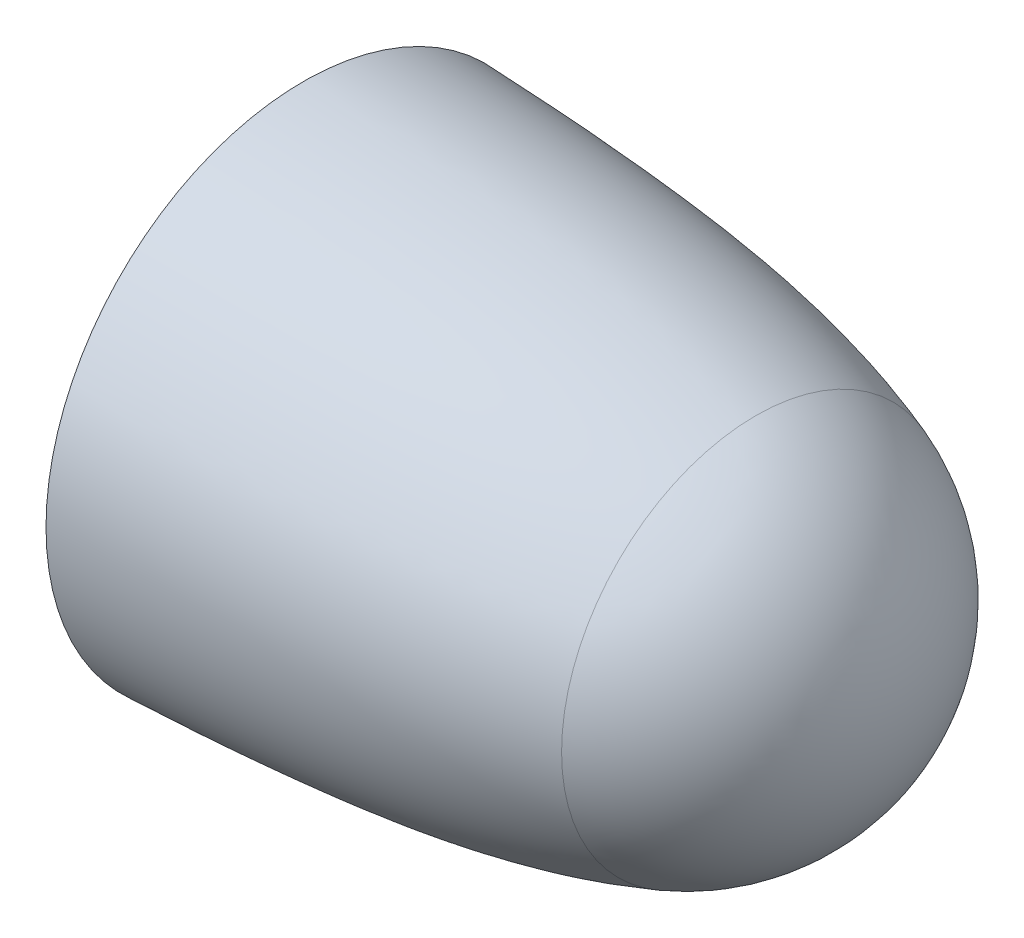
ISO-10303-21;
HEADER;
FILE_DESCRIPTION(('STEP AP214'),'2;1');
FILE_NAME('part.step','',(''),(''),'','','');
FILE_SCHEMA(('AUTOMOTIVE_DESIGN { 1 0 10303 214 1 1 1 1 }'));
ENDSEC;
DATA;
#1=APPLICATION_CONTEXT('core data for automotive mechanical design processes');
#2=APPLICATION_PROTOCOL_DEFINITION('international standard','automotive_design',2000,#1);
#3=PRODUCT_CONTEXT('',#1,'mechanical');
#4=PRODUCT('Part','Part','',(#3));
#5=PRODUCT_RELATED_PRODUCT_CATEGORY('part','',(#4));
#6=PRODUCT_DEFINITION_FORMATION('','',#4);
#7=PRODUCT_DEFINITION_CONTEXT('part definition',#1,'design');
#8=PRODUCT_DEFINITION('design','',#6,#7);
#9=PRODUCT_DEFINITION_SHAPE('','',#8);
#10=(LENGTH_UNIT() NAMED_UNIT(*) SI_UNIT(.MILLI.,.METRE.));
#11=(NAMED_UNIT(*) PLANE_ANGLE_UNIT() SI_UNIT($,.RADIAN.));
#12=(NAMED_UNIT(*) SI_UNIT($,.STERADIAN.) SOLID_ANGLE_UNIT());
#13=UNCERTAINTY_MEASURE_WITH_UNIT(LENGTH_MEASURE(1.E-05),#10,'distance_accuracy_value','');
#14=(GEOMETRIC_REPRESENTATION_CONTEXT(3) GLOBAL_UNCERTAINTY_ASSIGNED_CONTEXT((#13)) GLOBAL_UNIT_ASSIGNED_CONTEXT((#10,
#11,#12)) REPRESENTATION_CONTEXT('',''));
#15=CARTESIAN_POINT('',(0.,0.,0.));
#16=DIRECTION('',(0.,0.,1.));
#17=DIRECTION('',(1.,0.,0.));
#18=AXIS2_PLACEMENT_3D('',#15,#16,#17);
#19=CARTESIAN_POINT('',(5045.37811204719,301.379838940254,0.));
#20=CARTESIAN_POINT('',(4898.10578917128,353.95226404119,0.));
#21=CARTESIAN_POINT('',(4444.95601981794,411.256271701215,0.));
#22=CARTESIAN_POINT('',(3979.80182322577,405.13,0.));
#23=CARTESIAN_POINT('',(3686.81,405.13,0.));
#24=B_SPLINE_CURVE_WITH_KNOTS('',3,(#19,#20,#21,#22,#23),.UNSPECIFIED.,.F.,.F.,(4,1,4),(0.,
0.339771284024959,1.),.UNSPECIFIED.);
#25=CARTESIAN_POINT('',(4343.37858547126,2.54136989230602E-13,0.));
#26=DIRECTION('',(-1.,0.,0.));
#27=AXIS1_PLACEMENT('',#25,#26);
#28=SURFACE_OF_REVOLUTION('',#24,#27);
#29=CARTESIAN_POINT('',(4343.39999999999,2.54136989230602E-13,0.));
#30=DIRECTION('',(-1.,0.,0.));
#31=DIRECTION('',(0.,0.,1.));
#32=AXIS2_PLACEMENT_3D('',#29,#30,#31);
#33=CIRCLE('',#32,399.270494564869);
#34=CARTESIAN_POINT('',(4343.39999999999,2.54136989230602E-13,399.270494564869));
#35=VERTEX_POINT('',#34);
#36=EDGE_CURVE('E46',#35,#35,#33,.T.);
#37=ORIENTED_EDGE('',*,*,#36,.F.);
#38=EDGE_LOOP('',(#37));
#39=FACE_BOUND('',#38,.T.);
#40=CARTESIAN_POINT('',(5045.37811204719,2.54136989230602E-13,0.));
#41=DIRECTION('',(-1.,0.,0.));
#42=DIRECTION('',(0.,0.,1.));
#43=AXIS2_PLACEMENT_3D('',#40,#41,#42);
#44=CIRCLE('',#43,301.379838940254);
#45=CARTESIAN_POINT('',(5045.37811204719,2.54136989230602E-13,301.379838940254));
#46=VERTEX_POINT('',#45);
#47=EDGE_CURVE('E10',#46,#46,#44,.T.);
#48=ORIENTED_EDGE('',*,*,#47,.T.);
#49=EDGE_LOOP('',(#48));
#50=FACE_BOUND('',#49,.T.);
#51=ADVANCED_FACE('F31',(#39,#50),#28,.T.);
#52=CARTESIAN_POINT('',(4937.79327397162,0.,0.));
#53=DIRECTION('',(-1.,0.,0.));
#54=DIRECTION('',(0.,1.,0.));
#55=AXIS2_PLACEMENT_3D('',#52,#53,#54);
#56=SPHERICAL_SURFACE('',#55,320.006726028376);
#57=ORIENTED_EDGE('',*,*,#47,.F.);
#58=EDGE_LOOP('',(#57));
#59=FACE_BOUND('',#58,.T.);
#60=ADVANCED_FACE('F69',(#59),#56,.T.);
#61=CARTESIAN_POINT('',(4937.79327397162,0.,0.));
#62=DIRECTION('',(-1.,0.,0.));
#63=DIRECTION('',(0.,1.,0.));
#64=AXIS2_PLACEMENT_3D('',#61,#62,#63);
#65=SPHERICAL_SURFACE('',#64,313.656726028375);
#66=CARTESIAN_POINT('',(5043.24327028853,2.54136989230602E-13,0.));
#67=DIRECTION('',(-1.,0.,0.));
#68=DIRECTION('',(0.,0.,1.));
#69=AXIS2_PLACEMENT_3D('',#66,#67,#68);
#70=CIRCLE('',#69,295.399458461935);
#71=CARTESIAN_POINT('',(5043.24327028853,2.54136989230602E-13,295.399458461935));
#72=VERTEX_POINT('',#71);
#73=EDGE_CURVE('E38',#72,#72,#70,.T.);
#74=ORIENTED_EDGE('',*,*,#73,.T.);
#75=EDGE_LOOP('',(#74));
#76=FACE_BOUND('',#75,.T.);
#77=ADVANCED_FACE('F66',(#76),#65,.F.);
#78=CARTESIAN_POINT('',(4343.17025857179,392.924651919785,0.));
#79=CARTESIAN_POINT('',(4372.89400357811,391.848549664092,0.));
#80=CARTESIAN_POINT('',(4432.34020504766,389.331119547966,0.));
#81=CARTESIAN_POINT('',(4521.3798641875,384.26513121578,0.));
#82=CARTESIAN_POINT('',(4610.203419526,377.77697179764,0.));
#83=CARTESIAN_POINT('',(4698.61021270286,369.504641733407,0.));
#84=CARTESIAN_POINT('',(4786.35751645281,358.298549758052,0.));
#85=CARTESIAN_POINT('',(4858.75230778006,345.649722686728,0.));
#86=CARTESIAN_POINT('',(4916.12294930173,333.011264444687,0.));
#87=CARTESIAN_POINT('',(4958.85043102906,322.141552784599,0.));
#88=CARTESIAN_POINT('',(4994.18949486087,311.81221914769,0.));
#89=CARTESIAN_POINT('',(5022.27599825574,302.723981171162,0.));
#90=CARTESIAN_POINT('',(5036.27521531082,297.886874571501,0.));
#91=CARTESIAN_POINT('',(5043.24327028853,295.399458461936,0.));
#92=B_SPLINE_CURVE_WITH_KNOTS('',3,(#78,#79,#80,#81,#82,#83,#84,#85,#86,#87,#88,#89,#90,#91),
.UNSPECIFIED.,.F.,.F.,(4,1,1,1,1,1,1,1,1,1,1,4),(0.,0.0647634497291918,0.129526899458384,
0.194290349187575,0.259053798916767,0.323817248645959,0.388580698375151,0.420962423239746,
0.453344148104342,0.485725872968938,0.501916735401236,0.518107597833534),.UNSPECIFIED.);
#93=CARTESIAN_POINT('',(4343.37858547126,2.54136989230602E-13,0.));
#94=DIRECTION('',(-1.,0.,0.));
#95=AXIS1_PLACEMENT('',#93,#94);
#96=SURFACE_OF_REVOLUTION('',#92,#95);
#97=ORIENTED_EDGE('',*,*,#73,.F.);
#98=EDGE_LOOP('',(#97));
#99=FACE_BOUND('',#98,.T.);
#100=CARTESIAN_POINT('',(4343.39999999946,2.54136989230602E-13,0.));
#101=DIRECTION('',(-1.,0.,0.));
#102=DIRECTION('',(0.,0.,1.));
#103=AXIS2_PLACEMENT_3D('',#100,#101,#102);
#104=CIRCLE('',#103,392.916330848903);
#105=CARTESIAN_POINT('',(4343.39999999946,2.54136989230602E-13,392.916330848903));
#106=VERTEX_POINT('',#105);
#107=EDGE_CURVE('E42',#106,#106,#104,.T.);
#108=ORIENTED_EDGE('',*,*,#107,.T.);
#109=EDGE_LOOP('',(#108));
#110=FACE_BOUND('',#109,.T.);
#111=ADVANCED_FACE('F61',(#99,#110),#96,.T.);
#112=CARTESIAN_POINT('',(4343.39999999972,399.270494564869,0.));
#113=DIRECTION('',(1.,0.,0.));
#114=DIRECTION('',(0.,0.,-1.));
#115=AXIS2_PLACEMENT_3D('',#112,#113,#114);
#116=PLANE('',#115);
#117=ORIENTED_EDGE('',*,*,#107,.F.);
#118=EDGE_LOOP('',(#117));
#119=FACE_BOUND('',#118,.T.);
#120=ORIENTED_EDGE('',*,*,#36,.T.);
#121=EDGE_LOOP('',(#120));
#122=FACE_BOUND('',#121,.T.);
#123=ADVANCED_FACE('F65',(#119,#122),#116,.F.);
#124=CLOSED_SHELL('',(#51,#60,#77,#111,#123));
#125=MANIFOLD_SOLID_BREP('B2',#124);
#126=ADVANCED_BREP_SHAPE_REPRESENTATION('',(#18,#125),#14);
#127=SHAPE_DEFINITION_REPRESENTATION(#9,#126);
ENDSEC;
END-ISO-10303-21;
